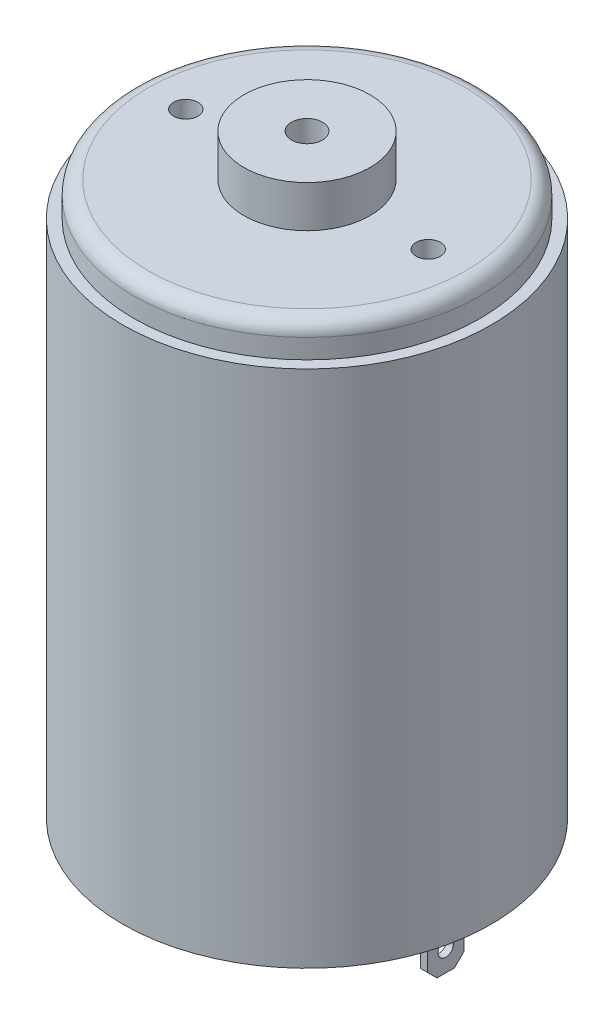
ISO-10303-21;
HEADER;
FILE_DESCRIPTION(('STEP AP214'),'2;1');
FILE_NAME('part.step','',(''),(''),'','','');
FILE_SCHEMA(('AUTOMOTIVE_DESIGN { 1 0 10303 214 1 1 1 1 }'));
ENDSEC;
DATA;
#1=APPLICATION_CONTEXT('core data for automotive mechanical design processes');
#2=APPLICATION_PROTOCOL_DEFINITION('international standard','automotive_design',2000,#1);
#3=PRODUCT_CONTEXT('',#1,'mechanical');
#4=PRODUCT('Part','Part','',(#3));
#5=PRODUCT_RELATED_PRODUCT_CATEGORY('part','',(#4));
#6=PRODUCT_DEFINITION_FORMATION('','',#4);
#7=PRODUCT_DEFINITION_CONTEXT('part definition',#1,'design');
#8=PRODUCT_DEFINITION('design','',#6,#7);
#9=PRODUCT_DEFINITION_SHAPE('','',#8);
#10=(LENGTH_UNIT() NAMED_UNIT(*) SI_UNIT(.MILLI.,.METRE.));
#11=(NAMED_UNIT(*) PLANE_ANGLE_UNIT() SI_UNIT($,.RADIAN.));
#12=(NAMED_UNIT(*) SI_UNIT($,.STERADIAN.) SOLID_ANGLE_UNIT());
#13=UNCERTAINTY_MEASURE_WITH_UNIT(LENGTH_MEASURE(1.E-05),#10,'distance_accuracy_value','');
#14=(GEOMETRIC_REPRESENTATION_CONTEXT(3) GLOBAL_UNCERTAINTY_ASSIGNED_CONTEXT((#13)) GLOBAL_UNIT_ASSIGNED_CONTEXT((#10,
#11,#12)) REPRESENTATION_CONTEXT('',''));
#15=CARTESIAN_POINT('',(0.,0.,0.));
#16=DIRECTION('',(0.,0.,1.));
#17=DIRECTION('',(1.,0.,0.));
#18=AXIS2_PLACEMENT_3D('',#15,#16,#17);
#19=CARTESIAN_POINT('',(-5.075,4.5,0.));
#20=DIRECTION('',(0.,1.,0.));
#21=DIRECTION('',(0.,0.,1.));
#22=AXIS2_PLACEMENT_3D('',#19,#20,#21);
#23=PLANE('',#22);
#24=DIRECTION('',(0.,0.,-1.));
#25=VECTOR('',#24,1.);
#26=CARTESIAN_POINT('',(-14.3,4.5,1.9));
#27=LINE('',#26,#25);
#28=CARTESIAN_POINT('',(-14.3,4.5,1.9));
#29=VERTEX_POINT('',#28);
#30=CARTESIAN_POINT('',(-14.3,4.5,-1.9));
#31=VERTEX_POINT('',#30);
#32=EDGE_CURVE('E182',#29,#31,#27,.T.);
#33=ORIENTED_EDGE('',*,*,#32,.F.);
#34=DIRECTION('',(-1.,0.,0.));
#35=VECTOR('',#34,1.);
#36=CARTESIAN_POINT('',(-14.3,4.5,1.9));
#37=LINE('',#36,#35);
#38=CARTESIAN_POINT('',(-13.6,4.5,1.9));
#39=VERTEX_POINT('',#38);
#40=EDGE_CURVE('E178',#39,#29,#37,.T.);
#41=ORIENTED_EDGE('',*,*,#40,.F.);
#42=DIRECTION('',(0.,0.,1.));
#43=VECTOR('',#42,1.);
#44=CARTESIAN_POINT('',(-13.6,4.5,1.9));
#45=LINE('',#44,#43);
#46=CARTESIAN_POINT('',(-13.6,4.5,-1.9));
#47=VERTEX_POINT('',#46);
#48=EDGE_CURVE('E188',#47,#39,#45,.T.);
#49=ORIENTED_EDGE('',*,*,#48,.F.);
#50=DIRECTION('',(1.,0.,0.));
#51=VECTOR('',#50,1.);
#52=CARTESIAN_POINT('',(-14.3,4.5,-1.9));
#53=LINE('',#52,#51);
#54=EDGE_CURVE('E185',#31,#47,#53,.T.);
#55=ORIENTED_EDGE('',*,*,#54,.F.);
#56=EDGE_LOOP('',(#33,#41,#49,#55));
#57=FACE_BOUND('',#56,.T.);
#58=CARTESIAN_POINT('',(0.,4.5,0.));
#59=DIRECTION('',(0.,-1.,0.));
#60=DIRECTION('',(0.,0.,-1.));
#61=AXIS2_PLACEMENT_3D('',#58,#59,#60);
#62=CIRCLE('',#61,5.075);
#63=CARTESIAN_POINT('',(0.,4.5,-5.075));
#64=VERTEX_POINT('',#63);
#65=EDGE_CURVE('E233',#64,#64,#62,.T.);
#66=ORIENTED_EDGE('',*,*,#65,.F.);
#67=EDGE_LOOP('',(#66));
#68=FACE_BOUND('',#67,.T.);
#69=CARTESIAN_POINT('',(0.,4.5,0.));
#70=DIRECTION('',(0.,-1.,0.));
#71=DIRECTION('',(0.,0.,-1.));
#72=AXIS2_PLACEMENT_3D('',#69,#70,#71);
#73=CIRCLE('',#72,19.);
#74=CARTESIAN_POINT('',(0.,4.5,-19.));
#75=VERTEX_POINT('',#74);
#76=EDGE_CURVE('E230',#75,#75,#73,.T.);
#77=ORIENTED_EDGE('',*,*,#76,.T.);
#78=EDGE_LOOP('',(#77));
#79=FACE_BOUND('',#78,.T.);
#80=DIRECTION('',(0.,0.,1.));
#81=VECTOR('',#80,1.);
#82=CARTESIAN_POINT('',(14.3,4.5,-1.9));
#83=LINE('',#82,#81);
#84=CARTESIAN_POINT('',(14.3,4.5,-1.9));
#85=VERTEX_POINT('',#84);
#86=CARTESIAN_POINT('',(14.3,4.5,1.9));
#87=VERTEX_POINT('',#86);
#88=EDGE_CURVE('E141',#85,#87,#83,.T.);
#89=ORIENTED_EDGE('',*,*,#88,.F.);
#90=DIRECTION('',(1.,0.,0.));
#91=VECTOR('',#90,1.);
#92=CARTESIAN_POINT('',(14.3,4.5,-1.9));
#93=LINE('',#92,#91);
#94=CARTESIAN_POINT('',(13.6,4.5,-1.9));
#95=VERTEX_POINT('',#94);
#96=EDGE_CURVE('E151',#95,#85,#93,.T.);
#97=ORIENTED_EDGE('',*,*,#96,.F.);
#98=DIRECTION('',(0.,0.,-1.));
#99=VECTOR('',#98,1.);
#100=CARTESIAN_POINT('',(13.6,4.5,-1.9));
#101=LINE('',#100,#99);
#102=CARTESIAN_POINT('',(13.6,4.5,1.9));
#103=VERTEX_POINT('',#102);
#104=EDGE_CURVE('E158',#103,#95,#101,.T.);
#105=ORIENTED_EDGE('',*,*,#104,.F.);
#106=DIRECTION('',(-1.,0.,0.));
#107=VECTOR('',#106,1.);
#108=CARTESIAN_POINT('',(14.3,4.5,1.9));
#109=LINE('',#108,#107);
#110=EDGE_CURVE('E154',#87,#103,#109,.T.);
#111=ORIENTED_EDGE('',*,*,#110,.F.);
#112=EDGE_LOOP('',(#89,#97,#105,#111));
#113=FACE_BOUND('',#112,.T.);
#114=ADVANCED_FACE('F41',(#57,#68,#79,#113),#23,.F.);
#115=CARTESIAN_POINT('',(-1.6,2.6,0.));
#116=DIRECTION('',(0.,1.,0.));
#117=DIRECTION('',(0.,0.,1.));
#118=AXIS2_PLACEMENT_3D('',#115,#116,#117);
#119=PLANE('',#118);
#120=CARTESIAN_POINT('',(0.,2.6,0.));
#121=DIRECTION('',(0.,1.,0.));
#122=DIRECTION('',(0.,0.,1.));
#123=AXIS2_PLACEMENT_3D('',#120,#121,#122);
#124=CIRCLE('',#123,1.6);
#125=CARTESIAN_POINT('',(0.,2.6,1.6));
#126=VERTEX_POINT('',#125);
#127=EDGE_CURVE('E416',#126,#126,#124,.T.);
#128=ORIENTED_EDGE('',*,*,#127,.T.);
#129=EDGE_LOOP('',(#128));
#130=FACE_BOUND('',#129,.T.);
#131=CARTESIAN_POINT('',(0.,2.6,0.));
#132=DIRECTION('',(0.,-1.,0.));
#133=DIRECTION('',(0.,0.,-1.));
#134=AXIS2_PLACEMENT_3D('',#131,#132,#133);
#135=CIRCLE('',#134,5.075);
#136=CARTESIAN_POINT('',(0.,2.6,-5.075));
#137=VERTEX_POINT('',#136);
#138=EDGE_CURVE('E236',#137,#137,#135,.T.);
#139=ORIENTED_EDGE('',*,*,#138,.T.);
#140=EDGE_LOOP('',(#139));
#141=FACE_BOUND('',#140,.T.);
#142=ADVANCED_FACE('F290',(#130,#141),#119,.F.);
#143=CARTESIAN_POINT('',(0.,0.,0.));
#144=DIRECTION('',(0.,-1.,0.));
#145=DIRECTION('',(0.,0.,-1.));
#146=AXIS2_PLACEMENT_3D('',#143,#144,#145);
#147=CYLINDRICAL_SURFACE('',#146,5.075);
#148=ORIENTED_EDGE('',*,*,#138,.F.);
#149=EDGE_LOOP('',(#148));
#150=FACE_BOUND('',#149,.T.);
#151=ORIENTED_EDGE('',*,*,#65,.T.);
#152=EDGE_LOOP('',(#151));
#153=FACE_BOUND('',#152,.T.);
#154=ADVANCED_FACE('F296',(#150,#153),#147,.T.);
#155=CARTESIAN_POINT('',(0.,0.,0.));
#156=DIRECTION('',(0.,-1.,0.));
#157=DIRECTION('',(0.,0.,-1.));
#158=AXIS2_PLACEMENT_3D('',#155,#156,#157);
#159=CYLINDRICAL_SURFACE('',#158,19.);
#160=ORIENTED_EDGE('',*,*,#76,.F.);
#161=EDGE_LOOP('',(#160));
#162=FACE_BOUND('',#161,.T.);
#163=CARTESIAN_POINT('',(0.,58.,0.));
#164=DIRECTION('',(0.,-1.,0.));
#165=DIRECTION('',(0.,0.,-1.));
#166=AXIS2_PLACEMENT_3D('',#163,#164,#165);
#167=CIRCLE('',#166,19.);
#168=CARTESIAN_POINT('',(0.,58.,-19.));
#169=VERTEX_POINT('',#168);
#170=EDGE_CURVE('E227',#169,#169,#167,.T.);
#171=ORIENTED_EDGE('',*,*,#170,.T.);
#172=EDGE_LOOP('',(#171));
#173=FACE_BOUND('',#172,.T.);
#174=ADVANCED_FACE('F303',(#162,#173),#159,.T.);
#175=CARTESIAN_POINT('',(-19.,58.,0.));
#176=DIRECTION('',(0.,-1.,0.));
#177=DIRECTION('',(0.,0.,-1.));
#178=AXIS2_PLACEMENT_3D('',#175,#176,#177);
#179=PLANE('',#178);
#180=ORIENTED_EDGE('',*,*,#170,.F.);
#181=EDGE_LOOP('',(#180));
#182=FACE_BOUND('',#181,.T.);
#183=CARTESIAN_POINT('',(0.,58.,0.));
#184=DIRECTION('',(0.,-1.,0.));
#185=DIRECTION('',(0.,0.,-1.));
#186=AXIS2_PLACEMENT_3D('',#183,#184,#185);
#187=CIRCLE('',#186,17.85);
#188=CARTESIAN_POINT('',(0.,58.,-17.85));
#189=VERTEX_POINT('',#188);
#190=EDGE_CURVE('E224',#189,#189,#187,.T.);
#191=ORIENTED_EDGE('',*,*,#190,.T.);
#192=EDGE_LOOP('',(#191));
#193=FACE_BOUND('',#192,.T.);
#194=ADVANCED_FACE('F391',(#182,#193),#179,.F.);
#195=CARTESIAN_POINT('',(0.,0.,0.));
#196=DIRECTION('',(0.,-1.,0.));
#197=DIRECTION('',(0.,0.,-1.));
#198=AXIS2_PLACEMENT_3D('',#195,#196,#197);
#199=CYLINDRICAL_SURFACE('',#198,17.85);
#200=ORIENTED_EDGE('',*,*,#190,.F.);
#201=EDGE_LOOP('',(#200));
#202=FACE_BOUND('',#201,.T.);
#203=CARTESIAN_POINT('',(0.,60.,0.));
#204=DIRECTION('',(0.,-1.,0.));
#205=DIRECTION('',(0.,0.,-1.));
#206=AXIS2_PLACEMENT_3D('',#203,#204,#205);
#207=CIRCLE('',#206,17.85);
#208=CARTESIAN_POINT('',(0.,60.,-17.85));
#209=VERTEX_POINT('',#208);
#210=EDGE_CURVE('E221',#209,#209,#207,.T.);
#211=ORIENTED_EDGE('',*,*,#210,.T.);
#212=EDGE_LOOP('',(#211));
#213=FACE_BOUND('',#212,.T.);
#214=ADVANCED_FACE('F388',(#202,#213),#199,.T.);
#215=CARTESIAN_POINT('',(0.,60.,0.));
#216=DIRECTION('',(0.,-1.,0.));
#217=DIRECTION('',(0.,0.,-1.));
#218=AXIS2_PLACEMENT_3D('',#215,#216,#217);
#219=TOROIDAL_SURFACE('',#218,16.35,1.5);
#220=ORIENTED_EDGE('',*,*,#210,.F.);
#221=EDGE_LOOP('',(#220));
#222=FACE_BOUND('',#221,.T.);
#223=CARTESIAN_POINT('',(0.,61.5,0.));
#224=DIRECTION('',(0.,-1.,0.));
#225=DIRECTION('',(0.,0.,-1.));
#226=AXIS2_PLACEMENT_3D('',#223,#224,#225);
#227=CIRCLE('',#226,16.35);
#228=CARTESIAN_POINT('',(0.,61.5,-16.35));
#229=VERTEX_POINT('',#228);
#230=EDGE_CURVE('E218',#229,#229,#227,.T.);
#231=ORIENTED_EDGE('',*,*,#230,.T.);
#232=EDGE_LOOP('',(#231));
#233=FACE_BOUND('',#232,.T.);
#234=ADVANCED_FACE('F384',(#222,#233),#219,.T.);
#235=CARTESIAN_POINT('',(-16.35,61.5,0.));
#236=DIRECTION('',(0.,-1.,0.));
#237=DIRECTION('',(0.,0.,-1.));
#238=AXIS2_PLACEMENT_3D('',#235,#236,#237);
#239=PLANE('',#238);
#240=CARTESIAN_POINT('',(-12.5,61.5,0.));
#241=DIRECTION('',(0.,1.,0.));
#242=DIRECTION('',(0.,0.,1.));
#243=AXIS2_PLACEMENT_3D('',#240,#241,#242);
#244=CIRCLE('',#243,1.25);
#245=CARTESIAN_POINT('',(-12.5,61.5,1.25));
#246=VERTEX_POINT('',#245);
#247=EDGE_CURVE('E200',#246,#246,#244,.T.);
#248=ORIENTED_EDGE('',*,*,#247,.F.);
#249=EDGE_LOOP('',(#248));
#250=FACE_BOUND('',#249,.T.);
#251=CARTESIAN_POINT('',(12.5,61.5,0.));
#252=DIRECTION('',(0.,1.,0.));
#253=DIRECTION('',(0.,0.,1.));
#254=AXIS2_PLACEMENT_3D('',#251,#252,#253);
#255=CIRCLE('',#254,1.25);
#256=CARTESIAN_POINT('',(12.5,61.5,1.24999999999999));
#257=VERTEX_POINT('',#256);
#258=EDGE_CURVE('E206',#257,#257,#255,.T.);
#259=ORIENTED_EDGE('',*,*,#258,.F.);
#260=EDGE_LOOP('',(#259));
#261=FACE_BOUND('',#260,.T.);
#262=ORIENTED_EDGE('',*,*,#230,.F.);
#263=EDGE_LOOP('',(#262));
#264=FACE_BOUND('',#263,.T.);
#265=CARTESIAN_POINT('',(0.,61.5,0.));
#266=DIRECTION('',(0.,-1.,0.));
#267=DIRECTION('',(0.,0.,-1.));
#268=AXIS2_PLACEMENT_3D('',#265,#266,#267);
#269=CIRCLE('',#268,6.5);
#270=CARTESIAN_POINT('',(0.,61.5,-6.5));
#271=VERTEX_POINT('',#270);
#272=EDGE_CURVE('E215',#271,#271,#269,.T.);
#273=ORIENTED_EDGE('',*,*,#272,.T.);
#274=EDGE_LOOP('',(#273));
#275=FACE_BOUND('',#274,.T.);
#276=ADVANCED_FACE('F380',(#250,#261,#264,#275),#239,.F.);
#277=CARTESIAN_POINT('',(0.,0.,0.));
#278=DIRECTION('',(0.,-1.,0.));
#279=DIRECTION('',(0.,0.,-1.));
#280=AXIS2_PLACEMENT_3D('',#277,#278,#279);
#281=CYLINDRICAL_SURFACE('',#280,6.5);
#282=ORIENTED_EDGE('',*,*,#272,.F.);
#283=EDGE_LOOP('',(#282));
#284=FACE_BOUND('',#283,.T.);
#285=CARTESIAN_POINT('',(0.,65.8,0.));
#286=DIRECTION('',(0.,-1.,0.));
#287=DIRECTION('',(0.,0.,-1.));
#288=AXIS2_PLACEMENT_3D('',#285,#286,#287);
#289=CIRCLE('',#288,6.5);
#290=CARTESIAN_POINT('',(0.,65.8,-6.5));
#291=VERTEX_POINT('',#290);
#292=EDGE_CURVE('E212',#291,#291,#289,.T.);
#293=ORIENTED_EDGE('',*,*,#292,.T.);
#294=EDGE_LOOP('',(#293));
#295=FACE_BOUND('',#294,.T.);
#296=ADVANCED_FACE('F376',(#284,#295),#281,.T.);
#297=CARTESIAN_POINT('',(-6.5,65.8,0.));
#298=DIRECTION('',(0.,-1.,0.));
#299=DIRECTION('',(0.,0.,-1.));
#300=AXIS2_PLACEMENT_3D('',#297,#298,#299);
#301=PLANE('',#300);
#302=ORIENTED_EDGE('',*,*,#292,.F.);
#303=EDGE_LOOP('',(#302));
#304=FACE_BOUND('',#303,.T.);
#305=CARTESIAN_POINT('',(0.,65.8,0.));
#306=DIRECTION('',(0.,-1.,0.));
#307=DIRECTION('',(0.,0.,-1.));
#308=AXIS2_PLACEMENT_3D('',#305,#306,#307);
#309=CIRCLE('',#308,1.6);
#310=CARTESIAN_POINT('',(0.,65.8,-1.6));
#311=VERTEX_POINT('',#310);
#312=EDGE_CURVE('E414',#311,#311,#309,.T.);
#313=ORIENTED_EDGE('',*,*,#312,.T.);
#314=EDGE_LOOP('',(#313));
#315=FACE_BOUND('',#314,.T.);
#316=ADVANCED_FACE('F372',(#304,#315),#301,.F.);
#317=CARTESIAN_POINT('',(12.5,53.,0.));
#318=DIRECTION('',(0.,1.,0.));
#319=DIRECTION('',(0.,0.,1.));
#320=AXIS2_PLACEMENT_3D('',#317,#318,#319);
#321=CONICAL_SURFACE('',#320,1.25,1.02974425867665);
#322=CARTESIAN_POINT('',(12.5,52.2489242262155,0.));
#323=VERTEX_POINT('',#322);
#324=VERTEX_LOOP('',#323);
#325=FACE_BOUND('',#324,.T.);
#326=CARTESIAN_POINT('',(12.5,53.,0.));
#327=DIRECTION('',(0.,1.,0.));
#328=DIRECTION('',(0.,0.,1.));
#329=AXIS2_PLACEMENT_3D('',#326,#327,#328);
#330=CIRCLE('',#329,1.25);
#331=CARTESIAN_POINT('',(12.5,53.,1.24999999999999));
#332=VERTEX_POINT('',#331);
#333=EDGE_CURVE('E209',#332,#332,#330,.T.);
#334=ORIENTED_EDGE('',*,*,#333,.T.);
#335=EDGE_LOOP('',(#334));
#336=FACE_BOUND('',#335,.T.);
#337=ADVANCED_FACE('F368',(#325,#336),#321,.F.);
#338=CARTESIAN_POINT('',(12.5,61.5,0.));
#339=DIRECTION('',(0.,1.,0.));
#340=DIRECTION('',(0.,0.,1.));
#341=AXIS2_PLACEMENT_3D('',#338,#339,#340);
#342=CYLINDRICAL_SURFACE('',#341,1.25);
#343=ORIENTED_EDGE('',*,*,#333,.F.);
#344=EDGE_LOOP('',(#343));
#345=FACE_BOUND('',#344,.T.);
#346=ORIENTED_EDGE('',*,*,#258,.T.);
#347=EDGE_LOOP('',(#346));
#348=FACE_BOUND('',#347,.T.);
#349=ADVANCED_FACE('F364',(#345,#348),#342,.F.);
#350=CARTESIAN_POINT('',(-12.5,53.,0.));
#351=DIRECTION('',(0.,1.,0.));
#352=DIRECTION('',(0.,0.,1.));
#353=AXIS2_PLACEMENT_3D('',#350,#351,#352);
#354=CONICAL_SURFACE('',#353,1.25,1.02974425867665);
#355=CARTESIAN_POINT('',(-12.5,52.2489242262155,0.));
#356=VERTEX_POINT('',#355);
#357=VERTEX_LOOP('',#356);
#358=FACE_BOUND('',#357,.T.);
#359=CARTESIAN_POINT('',(-12.5,53.,0.));
#360=DIRECTION('',(0.,1.,0.));
#361=DIRECTION('',(0.,0.,1.));
#362=AXIS2_PLACEMENT_3D('',#359,#360,#361);
#363=CIRCLE('',#362,1.25);
#364=CARTESIAN_POINT('',(-12.5,53.,1.25));
#365=VERTEX_POINT('',#364);
#366=EDGE_CURVE('E203',#365,#365,#363,.T.);
#367=ORIENTED_EDGE('',*,*,#366,.T.);
#368=EDGE_LOOP('',(#367));
#369=FACE_BOUND('',#368,.T.);
#370=ADVANCED_FACE('F360',(#358,#369),#354,.F.);
#371=CARTESIAN_POINT('',(-12.5,61.5,0.));
#372=DIRECTION('',(0.,1.,0.));
#373=DIRECTION('',(0.,0.,1.));
#374=AXIS2_PLACEMENT_3D('',#371,#372,#373);
#375=CYLINDRICAL_SURFACE('',#374,1.25);
#376=ORIENTED_EDGE('',*,*,#366,.F.);
#377=EDGE_LOOP('',(#376));
#378=FACE_BOUND('',#377,.T.);
#379=ORIENTED_EDGE('',*,*,#247,.T.);
#380=EDGE_LOOP('',(#379));
#381=FACE_BOUND('',#380,.T.);
#382=ADVANCED_FACE('F353',(#378,#381),#375,.F.);
#383=CARTESIAN_POINT('',(-14.3,-2.2,1.9));
#384=DIRECTION('',(1.,0.,0.));
#385=DIRECTION('',(0.,0.,-1.));
#386=AXIS2_PLACEMENT_3D('',#383,#384,#385);
#387=PLANE('',#386);
#388=CARTESIAN_POINT('',(-14.3,0.,0.));
#389=DIRECTION('',(-1.,0.,0.));
#390=DIRECTION('',(0.,0.,1.));
#391=AXIS2_PLACEMENT_3D('',#388,#389,#390);
#392=CIRCLE('',#391,0.8);
#393=CARTESIAN_POINT('',(-14.3,0.,0.8));
#394=VERTEX_POINT('',#393);
#395=EDGE_CURVE('E170',#394,#394,#392,.T.);
#396=ORIENTED_EDGE('',*,*,#395,.F.);
#397=EDGE_LOOP('',(#396));
#398=FACE_BOUND('',#397,.T.);
#399=DIRECTION('',(0.,0.,-1.));
#400=VECTOR('',#399,1.);
#401=CARTESIAN_POINT('',(-14.3,-2.2,1.9));
#402=LINE('',#401,#400);
#403=CARTESIAN_POINT('',(-14.3,-2.2,0.899999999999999));
#404=VERTEX_POINT('',#403);
#405=CARTESIAN_POINT('',(-14.3,-2.2,-0.899999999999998));
#406=VERTEX_POINT('',#405);
#407=EDGE_CURVE('E174',#404,#406,#402,.T.);
#408=ORIENTED_EDGE('',*,*,#407,.F.);
#409=DIRECTION('',(0.,0.707106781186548,0.707106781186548));
#410=VECTOR('',#409,1.);
#411=CARTESIAN_POINT('',(-14.3,-2.2,0.899999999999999));
#412=LINE('',#411,#410);
#413=CARTESIAN_POINT('',(-14.3,-1.2,1.9));
#414=VERTEX_POINT('',#413);
#415=EDGE_CURVE('E247',#404,#414,#412,.T.);
#416=ORIENTED_EDGE('',*,*,#415,.T.);
#417=DIRECTION('',(0.,1.,0.));
#418=VECTOR('',#417,1.);
#419=CARTESIAN_POINT('',(-14.3,-2.2,1.9));
#420=LINE('',#419,#418);
#421=EDGE_CURVE('E181',#414,#29,#420,.T.);
#422=ORIENTED_EDGE('',*,*,#421,.T.);
#423=ORIENTED_EDGE('',*,*,#32,.T.);
#424=DIRECTION('',(0.,1.,0.));
#425=VECTOR('',#424,1.);
#426=CARTESIAN_POINT('',(-14.3,-2.2,-1.9));
#427=LINE('',#426,#425);
#428=CARTESIAN_POINT('',(-14.3,-1.2,-1.9));
#429=VERTEX_POINT('',#428);
#430=EDGE_CURVE('E198',#429,#31,#427,.T.);
#431=ORIENTED_EDGE('',*,*,#430,.F.);
#432=DIRECTION('',(0.,-0.707106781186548,0.707106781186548));
#433=VECTOR('',#432,1.);
#434=CARTESIAN_POINT('',(-14.3,-2.2,-0.899999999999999));
#435=LINE('',#434,#433);
#436=EDGE_CURVE('E245',#429,#406,#435,.T.);
#437=ORIENTED_EDGE('',*,*,#436,.T.);
#438=EDGE_LOOP('',(#408,#416,#422,#423,#431,#437));
#439=FACE_BOUND('',#438,.T.);
#440=ADVANCED_FACE('F327',(#398,#439),#387,.F.);
#441=CARTESIAN_POINT('',(-14.3,-2.2,-1.9));
#442=DIRECTION('',(0.,0.,1.));
#443=DIRECTION('',(1.,0.,0.));
#444=AXIS2_PLACEMENT_3D('',#441,#442,#443);
#445=PLANE('',#444);
#446=DIRECTION('',(0.,1.,0.));
#447=VECTOR('',#446,1.);
#448=CARTESIAN_POINT('',(-13.6,-2.2,-1.9));
#449=LINE('',#448,#447);
#450=CARTESIAN_POINT('',(-13.6,-1.2,-1.9));
#451=VERTEX_POINT('',#450);
#452=EDGE_CURVE('E196',#451,#47,#449,.T.);
#453=ORIENTED_EDGE('',*,*,#452,.F.);
#454=DIRECTION('',(-1.,0.,0.));
#455=VECTOR('',#454,1.);
#456=CARTESIAN_POINT('',(-14.3,-1.2,-1.9));
#457=LINE('',#456,#455);
#458=EDGE_CURVE('E255',#451,#429,#457,.T.);
#459=ORIENTED_EDGE('',*,*,#458,.T.);
#460=ORIENTED_EDGE('',*,*,#430,.T.);
#461=ORIENTED_EDGE('',*,*,#54,.T.);
#462=EDGE_LOOP('',(#453,#459,#460,#461));
#463=FACE_BOUND('',#462,.T.);
#464=ADVANCED_FACE('F344',(#463),#445,.F.);
#465=CARTESIAN_POINT('',(-13.6,-2.2,1.9));
#466=DIRECTION('',(-1.,0.,0.));
#467=DIRECTION('',(0.,0.,1.));
#468=AXIS2_PLACEMENT_3D('',#465,#466,#467);
#469=PLANE('',#468);
#470=CARTESIAN_POINT('',(-13.6,0.,0.));
#471=DIRECTION('',(-1.,0.,0.));
#472=DIRECTION('',(0.,0.,1.));
#473=AXIS2_PLACEMENT_3D('',#470,#471,#472);
#474=CIRCLE('',#473,0.8);
#475=CARTESIAN_POINT('',(-13.6,0.,0.8));
#476=VERTEX_POINT('',#475);
#477=EDGE_CURVE('E173',#476,#476,#474,.T.);
#478=ORIENTED_EDGE('',*,*,#477,.T.);
#479=EDGE_LOOP('',(#478));
#480=FACE_BOUND('',#479,.T.);
#481=DIRECTION('',(0.,1.,0.));
#482=VECTOR('',#481,1.);
#483=CARTESIAN_POINT('',(-13.6,-2.2,1.9));
#484=LINE('',#483,#482);
#485=CARTESIAN_POINT('',(-13.6,-1.2,1.9));
#486=VERTEX_POINT('',#485);
#487=EDGE_CURVE('E194',#486,#39,#484,.T.);
#488=ORIENTED_EDGE('',*,*,#487,.F.);
#489=DIRECTION('',(0.,-0.707106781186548,-0.707106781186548));
#490=VECTOR('',#489,1.);
#491=CARTESIAN_POINT('',(-13.6,-2.2,0.899999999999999));
#492=LINE('',#491,#490);
#493=CARTESIAN_POINT('',(-13.6,-2.2,0.899999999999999));
#494=VERTEX_POINT('',#493);
#495=EDGE_CURVE('E253',#486,#494,#492,.T.);
#496=ORIENTED_EDGE('',*,*,#495,.T.);
#497=DIRECTION('',(0.,0.,1.));
#498=VECTOR('',#497,1.);
#499=CARTESIAN_POINT('',(-13.6,-2.2,1.9));
#500=LINE('',#499,#498);
#501=CARTESIAN_POINT('',(-13.6,-2.2,-0.899999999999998));
#502=VERTEX_POINT('',#501);
#503=EDGE_CURVE('E177',#502,#494,#500,.T.);
#504=ORIENTED_EDGE('',*,*,#503,.F.);
#505=DIRECTION('',(0.,0.707106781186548,-0.707106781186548));
#506=VECTOR('',#505,1.);
#507=CARTESIAN_POINT('',(-13.6,-2.2,-0.899999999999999));
#508=LINE('',#507,#506);
#509=EDGE_CURVE('E251',#502,#451,#508,.T.);
#510=ORIENTED_EDGE('',*,*,#509,.T.);
#511=ORIENTED_EDGE('',*,*,#452,.T.);
#512=ORIENTED_EDGE('',*,*,#48,.T.);
#513=EDGE_LOOP('',(#488,#496,#504,#510,#511,#512));
#514=FACE_BOUND('',#513,.T.);
#515=ADVANCED_FACE('F341',(#480,#514),#469,.F.);
#516=CARTESIAN_POINT('',(-14.3,-2.2,1.9));
#517=DIRECTION('',(0.,0.,-1.));
#518=DIRECTION('',(-1.,0.,0.));
#519=AXIS2_PLACEMENT_3D('',#516,#517,#518);
#520=PLANE('',#519);
#521=ORIENTED_EDGE('',*,*,#421,.F.);
#522=DIRECTION('',(1.,0.,0.));
#523=VECTOR('',#522,1.);
#524=CARTESIAN_POINT('',(-13.6,-1.2,1.9));
#525=LINE('',#524,#523);
#526=EDGE_CURVE('E249',#414,#486,#525,.T.);
#527=ORIENTED_EDGE('',*,*,#526,.T.);
#528=ORIENTED_EDGE('',*,*,#487,.T.);
#529=ORIENTED_EDGE('',*,*,#40,.T.);
#530=EDGE_LOOP('',(#521,#527,#528,#529));
#531=FACE_BOUND('',#530,.T.);
#532=ADVANCED_FACE('F335',(#531),#520,.F.);
#533=CARTESIAN_POINT('',(-14.3,-2.2,-1.9));
#534=DIRECTION('',(0.,-1.,0.));
#535=DIRECTION('',(0.,0.,-1.));
#536=AXIS2_PLACEMENT_3D('',#533,#534,#535);
#537=PLANE('',#536);
#538=ORIENTED_EDGE('',*,*,#503,.T.);
#539=DIRECTION('',(-1.,0.,0.));
#540=VECTOR('',#539,1.);
#541=CARTESIAN_POINT('',(-14.3,-2.2,0.899999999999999));
#542=LINE('',#541,#540);
#543=EDGE_CURVE('E242',#494,#404,#542,.T.);
#544=ORIENTED_EDGE('',*,*,#543,.T.);
#545=ORIENTED_EDGE('',*,*,#407,.T.);
#546=DIRECTION('',(1.,0.,0.));
#547=VECTOR('',#546,1.);
#548=CARTESIAN_POINT('',(-13.6,-2.2,-0.899999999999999));
#549=LINE('',#548,#547);
#550=EDGE_CURVE('E239',#406,#502,#549,.T.);
#551=ORIENTED_EDGE('',*,*,#550,.T.);
#552=EDGE_LOOP('',(#538,#544,#545,#551));
#553=FACE_BOUND('',#552,.T.);
#554=ADVANCED_FACE('F311',(#553),#537,.T.);
#555=CARTESIAN_POINT('',(-14.3,-2.2,0.899999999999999));
#556=DIRECTION('',(0.,-0.707106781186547,0.707106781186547));
#557=DIRECTION('',(0.,-0.707106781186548,-0.707106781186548));
#558=AXIS2_PLACEMENT_3D('',#555,#556,#557);
#559=PLANE('',#558);
#560=ORIENTED_EDGE('',*,*,#495,.F.);
#561=ORIENTED_EDGE('',*,*,#526,.F.);
#562=ORIENTED_EDGE('',*,*,#415,.F.);
#563=ORIENTED_EDGE('',*,*,#543,.F.);
#564=EDGE_LOOP('',(#560,#561,#562,#563));
#565=FACE_BOUND('',#564,.T.);
#566=ADVANCED_FACE('F308',(#565),#559,.T.);
#567=CARTESIAN_POINT('',(-14.3,-2.2,-0.899999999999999));
#568=DIRECTION('',(0.,-0.707106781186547,-0.707106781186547));
#569=DIRECTION('',(0.,0.707106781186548,-0.707106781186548));
#570=AXIS2_PLACEMENT_3D('',#567,#568,#569);
#571=PLANE('',#570);
#572=ORIENTED_EDGE('',*,*,#436,.F.);
#573=ORIENTED_EDGE('',*,*,#458,.F.);
#574=ORIENTED_EDGE('',*,*,#509,.F.);
#575=ORIENTED_EDGE('',*,*,#550,.F.);
#576=EDGE_LOOP('',(#572,#573,#574,#575));
#577=FACE_BOUND('',#576,.T.);
#578=ADVANCED_FACE('F310',(#577),#571,.T.);
#579=CARTESIAN_POINT('',(-7.6,0.,0.));
#580=DIRECTION('',(-1.,0.,0.));
#581=DIRECTION('',(0.,0.,1.));
#582=AXIS2_PLACEMENT_3D('',#579,#580,#581);
#583=CYLINDRICAL_SURFACE('',#582,0.8);
#584=ORIENTED_EDGE('',*,*,#395,.T.);
#585=EDGE_LOOP('',(#584));
#586=FACE_BOUND('',#585,.T.);
#587=ORIENTED_EDGE('',*,*,#477,.F.);
#588=EDGE_LOOP('',(#587));
#589=FACE_BOUND('',#588,.T.);
#590=ADVANCED_FACE('F314',(#586,#589),#583,.F.);
#591=CARTESIAN_POINT('',(14.3,-2.2,-1.9));
#592=DIRECTION('',(-1.,0.,0.));
#593=DIRECTION('',(0.,0.,1.));
#594=AXIS2_PLACEMENT_3D('',#591,#592,#593);
#595=PLANE('',#594);
#596=CARTESIAN_POINT('',(14.3,0.,0.));
#597=DIRECTION('',(1.,0.,0.));
#598=DIRECTION('',(0.,0.,-1.));
#599=AXIS2_PLACEMENT_3D('',#596,#597,#598);
#600=CIRCLE('',#599,0.8);
#601=CARTESIAN_POINT('',(14.3,0.,-0.8));
#602=VERTEX_POINT('',#601);
#603=EDGE_CURVE('E419',#602,#602,#600,.T.);
#604=ORIENTED_EDGE('',*,*,#603,.F.);
#605=EDGE_LOOP('',(#604));
#606=FACE_BOUND('',#605,.T.);
#607=DIRECTION('',(0.,0.,1.));
#608=VECTOR('',#607,1.);
#609=CARTESIAN_POINT('',(14.3,-2.2,-1.9));
#610=LINE('',#609,#608);
#611=CARTESIAN_POINT('',(14.3,-2.2,-0.899999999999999));
#612=VERTEX_POINT('',#611);
#613=CARTESIAN_POINT('',(14.3,-2.2,0.899999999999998));
#614=VERTEX_POINT('',#613);
#615=EDGE_CURVE('E157',#612,#614,#610,.T.);
#616=ORIENTED_EDGE('',*,*,#615,.F.);
#617=DIRECTION('',(0.,0.707106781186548,-0.707106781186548));
#618=VECTOR('',#617,1.);
#619=CARTESIAN_POINT('',(14.3,-2.2,-0.899999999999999));
#620=LINE('',#619,#618);
#621=CARTESIAN_POINT('',(14.3,-1.2,-1.9));
#622=VERTEX_POINT('',#621);
#623=EDGE_CURVE('E142',#612,#622,#620,.T.);
#624=ORIENTED_EDGE('',*,*,#623,.T.);
#625=DIRECTION('',(0.,1.,0.));
#626=VECTOR('',#625,1.);
#627=CARTESIAN_POINT('',(14.3,-2.2,-1.9));
#628=LINE('',#627,#626);
#629=EDGE_CURVE('E136',#622,#85,#628,.T.);
#630=ORIENTED_EDGE('',*,*,#629,.T.);
#631=ORIENTED_EDGE('',*,*,#88,.T.);
#632=DIRECTION('',(0.,1.,0.));
#633=VECTOR('',#632,1.);
#634=CARTESIAN_POINT('',(14.3,-2.2,1.9));
#635=LINE('',#634,#633);
#636=CARTESIAN_POINT('',(14.3,-1.2,1.9));
#637=VERTEX_POINT('',#636);
#638=EDGE_CURVE('E168',#637,#87,#635,.T.);
#639=ORIENTED_EDGE('',*,*,#638,.F.);
#640=DIRECTION('',(0.,-0.707106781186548,-0.707106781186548));
#641=VECTOR('',#640,1.);
#642=CARTESIAN_POINT('',(14.3,-2.2,0.899999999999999));
#643=LINE('',#642,#641);
#644=EDGE_CURVE('E265',#637,#614,#643,.T.);
#645=ORIENTED_EDGE('',*,*,#644,.T.);
#646=EDGE_LOOP('',(#616,#624,#630,#631,#639,#645));
#647=FACE_BOUND('',#646,.T.);
#648=ADVANCED_FACE('F139',(#606,#647),#595,.F.);
#649=CARTESIAN_POINT('',(14.3,-2.2,1.9));
#650=DIRECTION('',(0.,0.,-1.));
#651=DIRECTION('',(-1.,0.,0.));
#652=AXIS2_PLACEMENT_3D('',#649,#650,#651);
#653=PLANE('',#652);
#654=DIRECTION('',(0.,1.,0.));
#655=VECTOR('',#654,1.);
#656=CARTESIAN_POINT('',(13.6,-2.2,1.9));
#657=LINE('',#656,#655);
#658=CARTESIAN_POINT('',(13.6,-1.2,1.9));
#659=VERTEX_POINT('',#658);
#660=EDGE_CURVE('E166',#659,#103,#657,.T.);
#661=ORIENTED_EDGE('',*,*,#660,.F.);
#662=DIRECTION('',(1.,0.,0.));
#663=VECTOR('',#662,1.);
#664=CARTESIAN_POINT('',(14.3,-1.2,1.9));
#665=LINE('',#664,#663);
#666=EDGE_CURVE('E11',#659,#637,#665,.T.);
#667=ORIENTED_EDGE('',*,*,#666,.T.);
#668=ORIENTED_EDGE('',*,*,#638,.T.);
#669=ORIENTED_EDGE('',*,*,#110,.T.);
#670=EDGE_LOOP('',(#661,#667,#668,#669));
#671=FACE_BOUND('',#670,.T.);
#672=ADVANCED_FACE('F424',(#671),#653,.F.);
#673=CARTESIAN_POINT('',(13.6,-2.2,-1.9));
#674=DIRECTION('',(1.,0.,0.));
#675=DIRECTION('',(0.,0.,-1.));
#676=AXIS2_PLACEMENT_3D('',#673,#674,#675);
#677=PLANE('',#676);
#678=CARTESIAN_POINT('',(13.6,0.,0.));
#679=DIRECTION('',(1.,0.,0.));
#680=DIRECTION('',(0.,0.,-1.));
#681=AXIS2_PLACEMENT_3D('',#678,#679,#680);
#682=CIRCLE('',#681,0.8);
#683=CARTESIAN_POINT('',(13.6,0.,-0.8));
#684=VERTEX_POINT('',#683);
#685=EDGE_CURVE('E45',#684,#684,#682,.T.);
#686=ORIENTED_EDGE('',*,*,#685,.T.);
#687=EDGE_LOOP('',(#686));
#688=FACE_BOUND('',#687,.T.);
#689=DIRECTION('',(0.,1.,0.));
#690=VECTOR('',#689,1.);
#691=CARTESIAN_POINT('',(13.6,-2.2,-1.9));
#692=LINE('',#691,#690);
#693=CARTESIAN_POINT('',(13.6,-1.2,-1.9));
#694=VERTEX_POINT('',#693);
#695=EDGE_CURVE('E144',#694,#95,#692,.T.);
#696=ORIENTED_EDGE('',*,*,#695,.F.);
#697=DIRECTION('',(0.,-0.707106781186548,0.707106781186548));
#698=VECTOR('',#697,1.);
#699=CARTESIAN_POINT('',(13.6,-2.2,-0.899999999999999));
#700=LINE('',#699,#698);
#701=CARTESIAN_POINT('',(13.6,-2.2,-0.899999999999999));
#702=VERTEX_POINT('',#701);
#703=EDGE_CURVE('E50',#694,#702,#700,.T.);
#704=ORIENTED_EDGE('',*,*,#703,.T.);
#705=DIRECTION('',(0.,0.,-1.));
#706=VECTOR('',#705,1.);
#707=CARTESIAN_POINT('',(13.6,-2.2,-1.9));
#708=LINE('',#707,#706);
#709=CARTESIAN_POINT('',(13.6,-2.2,0.899999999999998));
#710=VERTEX_POINT('',#709);
#711=EDGE_CURVE('E145',#710,#702,#708,.T.);
#712=ORIENTED_EDGE('',*,*,#711,.F.);
#713=DIRECTION('',(0.,0.707106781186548,0.707106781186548));
#714=VECTOR('',#713,1.);
#715=CARTESIAN_POINT('',(13.6,-2.2,0.899999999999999));
#716=LINE('',#715,#714);
#717=EDGE_CURVE('E57',#710,#659,#716,.T.);
#718=ORIENTED_EDGE('',*,*,#717,.T.);
#719=ORIENTED_EDGE('',*,*,#660,.T.);
#720=ORIENTED_EDGE('',*,*,#104,.T.);
#721=EDGE_LOOP('',(#696,#704,#712,#718,#719,#720));
#722=FACE_BOUND('',#721,.T.);
#723=ADVANCED_FACE('F272',(#688,#722),#677,.F.);
#724=CARTESIAN_POINT('',(14.3,-2.2,-1.9));
#725=DIRECTION('',(0.,0.,1.));
#726=DIRECTION('',(1.,0.,0.));
#727=AXIS2_PLACEMENT_3D('',#724,#725,#726);
#728=PLANE('',#727);
#729=ORIENTED_EDGE('',*,*,#629,.F.);
#730=DIRECTION('',(-1.,0.,0.));
#731=VECTOR('',#730,1.);
#732=CARTESIAN_POINT('',(13.6,-1.2,-1.9));
#733=LINE('',#732,#731);
#734=EDGE_CURVE('E65',#622,#694,#733,.T.);
#735=ORIENTED_EDGE('',*,*,#734,.T.);
#736=ORIENTED_EDGE('',*,*,#695,.T.);
#737=ORIENTED_EDGE('',*,*,#96,.T.);
#738=EDGE_LOOP('',(#729,#735,#736,#737));
#739=FACE_BOUND('',#738,.T.);
#740=ADVANCED_FACE('F156',(#739),#728,.F.);
#741=CARTESIAN_POINT('',(14.3,-2.2,1.9));
#742=DIRECTION('',(0.,-1.,0.));
#743=DIRECTION('',(0.,0.,1.));
#744=AXIS2_PLACEMENT_3D('',#741,#742,#743);
#745=PLANE('',#744);
#746=ORIENTED_EDGE('',*,*,#711,.T.);
#747=DIRECTION('',(1.,0.,0.));
#748=VECTOR('',#747,1.);
#749=CARTESIAN_POINT('',(14.3,-2.2,-0.899999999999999));
#750=LINE('',#749,#748);
#751=EDGE_CURVE('E262',#702,#612,#750,.T.);
#752=ORIENTED_EDGE('',*,*,#751,.T.);
#753=ORIENTED_EDGE('',*,*,#615,.T.);
#754=DIRECTION('',(-1.,0.,0.));
#755=VECTOR('',#754,1.);
#756=CARTESIAN_POINT('',(13.6,-2.2,0.899999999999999));
#757=LINE('',#756,#755);
#758=EDGE_CURVE('E257',#614,#710,#757,.T.);
#759=ORIENTED_EDGE('',*,*,#758,.T.);
#760=EDGE_LOOP('',(#746,#752,#753,#759));
#761=FACE_BOUND('',#760,.T.);
#762=ADVANCED_FACE('F276',(#761),#745,.T.);
#763=CARTESIAN_POINT('',(14.3,-2.2,-0.899999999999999));
#764=DIRECTION('',(0.,-0.707106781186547,-0.707106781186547));
#765=DIRECTION('',(0.,0.707106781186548,-0.707106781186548));
#766=AXIS2_PLACEMENT_3D('',#763,#764,#765);
#767=PLANE('',#766);
#768=ORIENTED_EDGE('',*,*,#703,.F.);
#769=ORIENTED_EDGE('',*,*,#734,.F.);
#770=ORIENTED_EDGE('',*,*,#623,.F.);
#771=ORIENTED_EDGE('',*,*,#751,.F.);
#772=EDGE_LOOP('',(#768,#769,#770,#771));
#773=FACE_BOUND('',#772,.T.);
#774=ADVANCED_FACE('F279',(#773),#767,.T.);
#775=CARTESIAN_POINT('',(14.3,-2.2,0.899999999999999));
#776=DIRECTION('',(0.,-0.707106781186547,0.707106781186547));
#777=DIRECTION('',(0.,-0.707106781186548,-0.707106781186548));
#778=AXIS2_PLACEMENT_3D('',#775,#776,#777);
#779=PLANE('',#778);
#780=ORIENTED_EDGE('',*,*,#644,.F.);
#781=ORIENTED_EDGE('',*,*,#666,.F.);
#782=ORIENTED_EDGE('',*,*,#717,.F.);
#783=ORIENTED_EDGE('',*,*,#758,.F.);
#784=EDGE_LOOP('',(#780,#781,#782,#783));
#785=FACE_BOUND('',#784,.T.);
#786=ADVANCED_FACE('F43',(#785),#779,.T.);
#787=CARTESIAN_POINT('',(7.6,0.,0.));
#788=DIRECTION('',(1.,0.,0.));
#789=DIRECTION('',(0.,0.,-1.));
#790=AXIS2_PLACEMENT_3D('',#787,#788,#789);
#791=CYLINDRICAL_SURFACE('',#790,0.8);
#792=ORIENTED_EDGE('',*,*,#603,.T.);
#793=EDGE_LOOP('',(#792));
#794=FACE_BOUND('',#793,.T.);
#795=ORIENTED_EDGE('',*,*,#685,.F.);
#796=EDGE_LOOP('',(#795));
#797=FACE_BOUND('',#796,.T.);
#798=ADVANCED_FACE('F285',(#794,#797),#791,.F.);
#799=CARTESIAN_POINT('',(0.,85.,0.));
#800=DIRECTION('',(0.,-1.,0.));
#801=DIRECTION('',(0.,0.,-1.));
#802=AXIS2_PLACEMENT_3D('',#799,#800,#801);
#803=CYLINDRICAL_SURFACE('',#802,1.6);
#804=ORIENTED_EDGE('',*,*,#312,.F.);
#805=EDGE_LOOP('',(#804));
#806=FACE_BOUND('',#805,.T.);
#807=ORIENTED_EDGE('',*,*,#127,.F.);
#808=EDGE_LOOP('',(#807));
#809=FACE_BOUND('',#808,.T.);
#810=ADVANCED_FACE('F527',(#806,#809),#803,.F.);
#811=CLOSED_SHELL('',(#114,#142,#154,#174,#194,#214,#234,#276,#296,#316,#337,#349,#370,#382,
#440,#464,#515,#532,#554,#566,#578,#590,#648,#672,#723,#740,#762,#774,#786,#798,#810));
#812=MANIFOLD_SOLID_BREP('B2',#811);
#813=ADVANCED_BREP_SHAPE_REPRESENTATION('',(#18,#812),#14);
#814=SHAPE_DEFINITION_REPRESENTATION(#9,#813);
ENDSEC;
END-ISO-10303-21;
